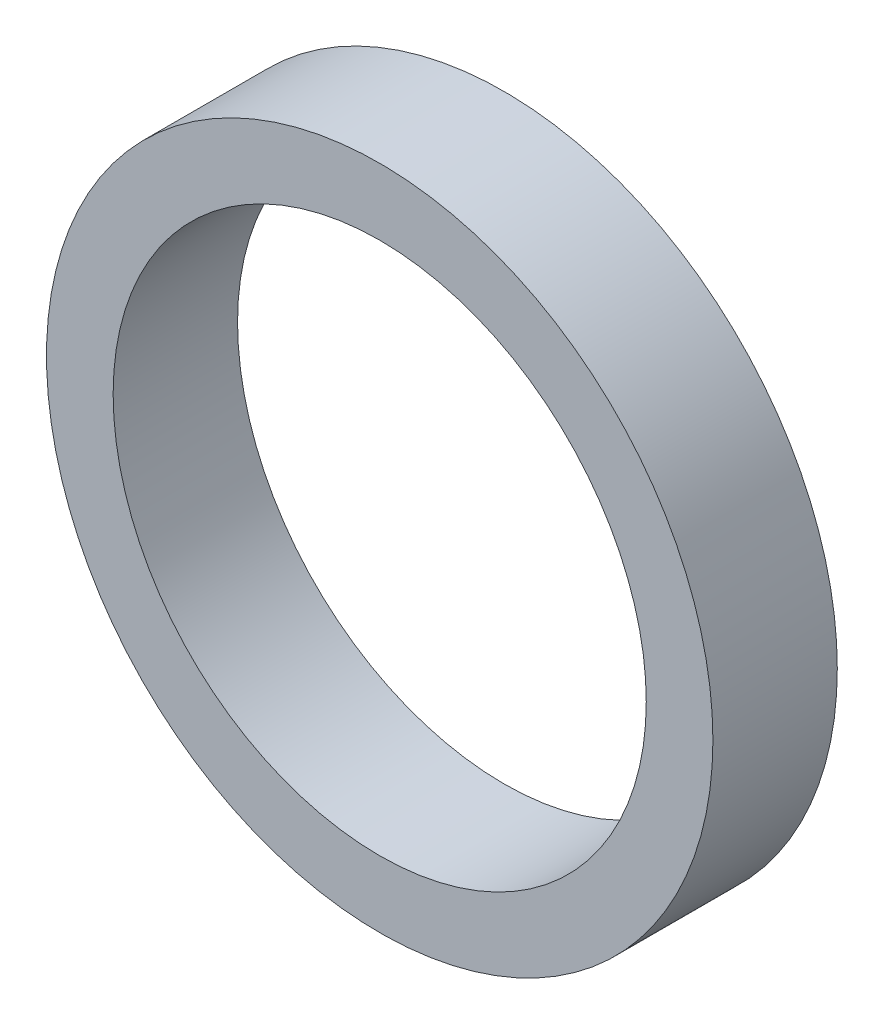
ISO-10303-21;
HEADER;
FILE_DESCRIPTION(('STEP AP214'),'2;1');
FILE_NAME('part.step','',(''),(''),'','','');
FILE_SCHEMA(('AUTOMOTIVE_DESIGN { 1 0 10303 214 1 1 1 1 }'));
ENDSEC;
DATA;
#1=APPLICATION_CONTEXT('core data for automotive mechanical design processes');
#2=APPLICATION_PROTOCOL_DEFINITION('international standard','automotive_design',2000,#1);
#3=PRODUCT_CONTEXT('',#1,'mechanical');
#4=PRODUCT('Part','Part','',(#3));
#5=PRODUCT_RELATED_PRODUCT_CATEGORY('part','',(#4));
#6=PRODUCT_DEFINITION_FORMATION('','',#4);
#7=PRODUCT_DEFINITION_CONTEXT('part definition',#1,'design');
#8=PRODUCT_DEFINITION('design','',#6,#7);
#9=PRODUCT_DEFINITION_SHAPE('','',#8);
#10=(LENGTH_UNIT() NAMED_UNIT(*) SI_UNIT(.MILLI.,.METRE.));
#11=(NAMED_UNIT(*) PLANE_ANGLE_UNIT() SI_UNIT($,.RADIAN.));
#12=(NAMED_UNIT(*) SI_UNIT($,.STERADIAN.) SOLID_ANGLE_UNIT());
#13=UNCERTAINTY_MEASURE_WITH_UNIT(LENGTH_MEASURE(1.E-05),#10,'distance_accuracy_value','');
#14=(GEOMETRIC_REPRESENTATION_CONTEXT(3) GLOBAL_UNCERTAINTY_ASSIGNED_CONTEXT((#13)) GLOBAL_UNIT_ASSIGNED_CONTEXT((#10,
#11,#12)) REPRESENTATION_CONTEXT('',''));
#15=CARTESIAN_POINT('',(0.,0.,0.));
#16=DIRECTION('',(0.,0.,1.));
#17=DIRECTION('',(1.,0.,0.));
#18=AXIS2_PLACEMENT_3D('',#15,#16,#17);
#19=CARTESIAN_POINT('',(0.,0.,1.39999999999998));
#20=DIRECTION('',(0.,0.,1.));
#21=DIRECTION('',(1.,0.,0.));
#22=AXIS2_PLACEMENT_3D('',#19,#20,#21);
#23=PLANE('',#22);
#24=CARTESIAN_POINT('',(0.,0.,1.39999999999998));
#25=DIRECTION('',(0.,0.,1.));
#26=DIRECTION('',(1.,0.,0.));
#27=AXIS2_PLACEMENT_3D('',#24,#25,#26);
#28=CIRCLE('',#27,7.5);
#29=CARTESIAN_POINT('',(7.49999999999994,0.,1.39999999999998));
#30=VERTEX_POINT('',#29);
#31=EDGE_CURVE('E10',#30,#30,#28,.T.);
#32=ORIENTED_EDGE('',*,*,#31,.T.);
#33=EDGE_LOOP('',(#32));
#34=FACE_BOUND('',#33,.T.);
#35=CARTESIAN_POINT('',(0.,0.,1.39999999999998));
#36=DIRECTION('',(0.,0.,1.));
#37=DIRECTION('',(1.,0.,0.));
#38=AXIS2_PLACEMENT_3D('',#35,#36,#37);
#39=CIRCLE('',#38,6.);
#40=CARTESIAN_POINT('',(5.99999999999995,0.,1.39999999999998));
#41=VERTEX_POINT('',#40);
#42=EDGE_CURVE('E42',#41,#41,#39,.T.);
#43=ORIENTED_EDGE('',*,*,#42,.F.);
#44=EDGE_LOOP('',(#43));
#45=FACE_BOUND('',#44,.T.);
#46=ADVANCED_FACE('F31',(#34,#45),#23,.T.);
#47=CARTESIAN_POINT('',(0.,0.,-1.40000000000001));
#48=DIRECTION('',(0.,0.,1.));
#49=DIRECTION('',(1.,0.,0.));
#50=AXIS2_PLACEMENT_3D('',#47,#48,#49);
#51=PLANE('',#50);
#52=CARTESIAN_POINT('',(0.,0.,-1.40000000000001));
#53=DIRECTION('',(0.,0.,1.));
#54=DIRECTION('',(1.,0.,0.));
#55=AXIS2_PLACEMENT_3D('',#52,#53,#54);
#56=CIRCLE('',#55,7.5);
#57=CARTESIAN_POINT('',(7.49999999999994,0.,-1.40000000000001));
#58=VERTEX_POINT('',#57);
#59=EDGE_CURVE('E38',#58,#58,#56,.T.);
#60=ORIENTED_EDGE('',*,*,#59,.F.);
#61=EDGE_LOOP('',(#60));
#62=FACE_BOUND('',#61,.T.);
#63=CARTESIAN_POINT('',(0.,0.,-1.40000000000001));
#64=DIRECTION('',(0.,0.,1.));
#65=DIRECTION('',(1.,0.,0.));
#66=AXIS2_PLACEMENT_3D('',#63,#64,#65);
#67=CIRCLE('',#66,6.);
#68=CARTESIAN_POINT('',(5.99999999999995,0.,-1.40000000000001));
#69=VERTEX_POINT('',#68);
#70=EDGE_CURVE('E46',#69,#69,#67,.T.);
#71=ORIENTED_EDGE('',*,*,#70,.T.);
#72=EDGE_LOOP('',(#71));
#73=FACE_BOUND('',#72,.T.);
#74=ADVANCED_FACE('F52',(#62,#73),#51,.F.);
#75=CARTESIAN_POINT('',(0.,0.,1.39999999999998));
#76=DIRECTION('',(0.,0.,-1.));
#77=DIRECTION('',(-1.,0.,0.));
#78=AXIS2_PLACEMENT_3D('',#75,#76,#77);
#79=CYLINDRICAL_SURFACE('',#78,7.5);
#80=ORIENTED_EDGE('',*,*,#31,.F.);
#81=EDGE_LOOP('',(#80));
#82=FACE_BOUND('',#81,.T.);
#83=ORIENTED_EDGE('',*,*,#59,.T.);
#84=EDGE_LOOP('',(#83));
#85=FACE_BOUND('',#84,.T.);
#86=ADVANCED_FACE('F33',(#82,#85),#79,.T.);
#87=CARTESIAN_POINT('',(0.,0.,1.39999999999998));
#88=DIRECTION('',(0.,0.,-1.));
#89=DIRECTION('',(-1.,0.,0.));
#90=AXIS2_PLACEMENT_3D('',#87,#88,#89);
#91=CYLINDRICAL_SURFACE('',#90,6.);
#92=ORIENTED_EDGE('',*,*,#42,.T.);
#93=EDGE_LOOP('',(#92));
#94=FACE_BOUND('',#93,.T.);
#95=ORIENTED_EDGE('',*,*,#70,.F.);
#96=EDGE_LOOP('',(#95));
#97=FACE_BOUND('',#96,.T.);
#98=ADVANCED_FACE('F54',(#94,#97),#91,.F.);
#99=CLOSED_SHELL('',(#46,#74,#86,#98));
#100=MANIFOLD_SOLID_BREP('B2',#99);
#101=ADVANCED_BREP_SHAPE_REPRESENTATION('',(#18,#100),#14);
#102=SHAPE_DEFINITION_REPRESENTATION(#9,#101);
ENDSEC;
END-ISO-10303-21;
